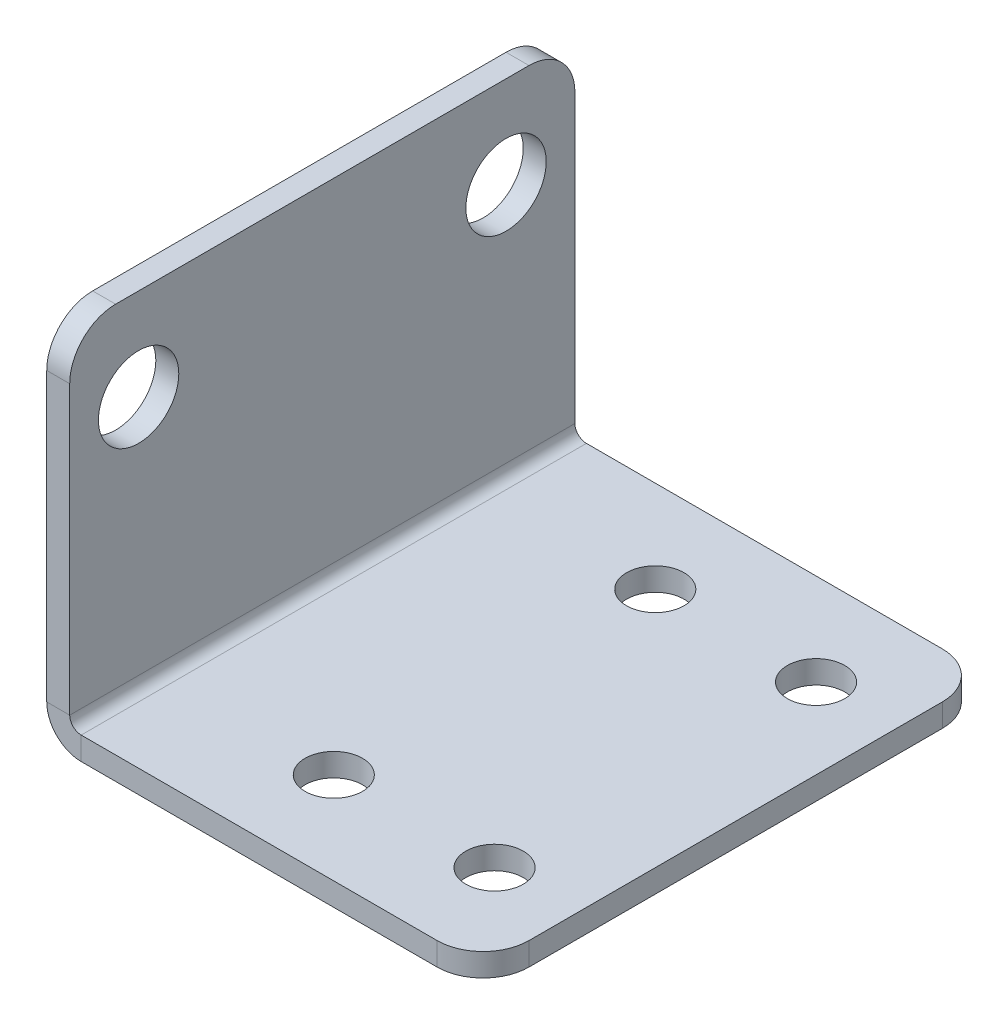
ISO-10303-21;
HEADER;
FILE_DESCRIPTION(('STEP AP214'),'2;1');
FILE_NAME('part.step','',(''),(''),'','','');
FILE_SCHEMA(('AUTOMOTIVE_DESIGN { 1 0 10303 214 1 1 1 1 }'));
ENDSEC;
DATA;
#1=APPLICATION_CONTEXT('core data for automotive mechanical design processes');
#2=APPLICATION_PROTOCOL_DEFINITION('international standard','automotive_design',2000,#1);
#3=PRODUCT_CONTEXT('',#1,'mechanical');
#4=PRODUCT('Part','Part','',(#3));
#5=PRODUCT_RELATED_PRODUCT_CATEGORY('part','',(#4));
#6=PRODUCT_DEFINITION_FORMATION('','',#4);
#7=PRODUCT_DEFINITION_CONTEXT('part definition',#1,'design');
#8=PRODUCT_DEFINITION('design','',#6,#7);
#9=PRODUCT_DEFINITION_SHAPE('','',#8);
#10=(LENGTH_UNIT() NAMED_UNIT(*) SI_UNIT(.MILLI.,.METRE.));
#11=(NAMED_UNIT(*) PLANE_ANGLE_UNIT() SI_UNIT($,.RADIAN.));
#12=(NAMED_UNIT(*) SI_UNIT($,.STERADIAN.) SOLID_ANGLE_UNIT());
#13=UNCERTAINTY_MEASURE_WITH_UNIT(LENGTH_MEASURE(1.E-05),#10,'distance_accuracy_value','');
#14=(GEOMETRIC_REPRESENTATION_CONTEXT(3) GLOBAL_UNCERTAINTY_ASSIGNED_CONTEXT((#13)) GLOBAL_UNIT_ASSIGNED_CONTEXT((#10,
#11,#12)) REPRESENTATION_CONTEXT('',''));
#15=CARTESIAN_POINT('',(0.,0.,0.));
#16=DIRECTION('',(0.,0.,1.));
#17=DIRECTION('',(1.,0.,0.));
#18=AXIS2_PLACEMENT_3D('',#15,#16,#17);
#19=CARTESIAN_POINT('',(0.5,0.,11.));
#20=DIRECTION('',(0.,0.,1.));
#21=DIRECTION('',(1.,0.,0.));
#22=AXIS2_PLACEMENT_3D('',#19,#20,#21);
#23=PLANE('',#22);
#24=DIRECTION('',(0.,-1.,0.));
#25=VECTOR('',#24,1.);
#26=CARTESIAN_POINT('',(0.5,0.,11.));
#27=LINE('',#26,#25);
#28=CARTESIAN_POINT('',(0.5,0.,11.));
#29=VERTEX_POINT('',#28);
#30=CARTESIAN_POINT('',(0.5,-1.,11.));
#31=VERTEX_POINT('',#30);
#32=EDGE_CURVE('E128',#29,#31,#27,.T.);
#33=ORIENTED_EDGE('',*,*,#32,.F.);
#34=CARTESIAN_POINT('',(0.5,0.5,11.));
#35=DIRECTION('',(0.,0.,-1.));
#36=DIRECTION('',(-1.,0.,0.));
#37=AXIS2_PLACEMENT_3D('',#34,#35,#36);
#38=CIRCLE('',#37,0.5);
#39=CARTESIAN_POINT('',(0.,0.5,11.));
#40=VERTEX_POINT('',#39);
#41=EDGE_CURVE('E132',#40,#29,#38,.F.);
#42=ORIENTED_EDGE('',*,*,#41,.F.);
#43=DIRECTION('',(1.,0.,0.));
#44=VECTOR('',#43,1.);
#45=CARTESIAN_POINT('',(-1.,0.500000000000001,11.));
#46=LINE('',#45,#44);
#47=CARTESIAN_POINT('',(-1.,0.500000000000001,11.));
#48=VERTEX_POINT('',#47);
#49=EDGE_CURVE('E140',#48,#40,#46,.T.);
#50=ORIENTED_EDGE('',*,*,#49,.F.);
#51=CARTESIAN_POINT('',(0.5,0.5,11.));
#52=DIRECTION('',(0.,0.,1.));
#53=DIRECTION('',(1.,0.,0.));
#54=AXIS2_PLACEMENT_3D('',#51,#52,#53);
#55=CIRCLE('',#54,1.5);
#56=EDGE_CURVE('E134',#48,#31,#55,.T.);
#57=ORIENTED_EDGE('',*,*,#56,.T.);
#58=EDGE_LOOP('',(#33,#42,#50,#57));
#59=FACE_BOUND('',#58,.T.);
#60=ADVANCED_FACE('F38',(#59),#23,.T.);
#61=CARTESIAN_POINT('',(-1.,0.500000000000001,11.));
#62=DIRECTION('',(0.,0.,1.));
#63=DIRECTION('',(1.,0.,0.));
#64=AXIS2_PLACEMENT_3D('',#61,#62,#63);
#65=PLANE('',#64);
#66=DIRECTION('',(1.,0.,0.));
#67=VECTOR('',#66,1.);
#68=CARTESIAN_POINT('',(0.,-1.,11.));
#69=LINE('',#68,#67);
#70=CARTESIAN_POINT('',(16.,-1.,11.));
#71=VERTEX_POINT('',#70);
#72=EDGE_CURVE('E162',#31,#71,#69,.T.);
#73=ORIENTED_EDGE('',*,*,#72,.T.);
#74=DIRECTION('',(0.,-1.,0.));
#75=VECTOR('',#74,1.);
#76=CARTESIAN_POINT('',(16.,0.500000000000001,11.));
#77=LINE('',#76,#75);
#78=CARTESIAN_POINT('',(16.,0.,11.));
#79=VERTEX_POINT('',#78);
#80=EDGE_CURVE('E161',#71,#79,#77,.F.);
#81=ORIENTED_EDGE('',*,*,#80,.T.);
#82=DIRECTION('',(1.,0.,0.));
#83=VECTOR('',#82,1.);
#84=CARTESIAN_POINT('',(0.,0.,11.));
#85=LINE('',#84,#83);
#86=EDGE_CURVE('E149',#29,#79,#85,.T.);
#87=ORIENTED_EDGE('',*,*,#86,.F.);
#88=ORIENTED_EDGE('',*,*,#32,.T.);
#89=EDGE_LOOP('',(#73,#81,#87,#88));
#90=FACE_BOUND('',#89,.T.);
#91=ADVANCED_FACE('F159',(#90),#65,.T.);
#92=CARTESIAN_POINT('',(0.,0.5,-11.));
#93=DIRECTION('',(0.,0.,-1.));
#94=DIRECTION('',(-1.,0.,0.));
#95=AXIS2_PLACEMENT_3D('',#92,#93,#94);
#96=PLANE('',#95);
#97=DIRECTION('',(-1.,0.,0.));
#98=VECTOR('',#97,1.);
#99=CARTESIAN_POINT('',(0.,0.5,-11.));
#100=LINE('',#99,#98);
#101=CARTESIAN_POINT('',(0.,0.5,-11.));
#102=VERTEX_POINT('',#101);
#103=CARTESIAN_POINT('',(-1.,0.500000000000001,-11.));
#104=VERTEX_POINT('',#103);
#105=EDGE_CURVE('E206',#102,#104,#100,.T.);
#106=ORIENTED_EDGE('',*,*,#105,.F.);
#107=CARTESIAN_POINT('',(0.5,0.5,-11.));
#108=DIRECTION('',(0.,0.,-1.));
#109=DIRECTION('',(-1.,0.,0.));
#110=AXIS2_PLACEMENT_3D('',#107,#108,#109);
#111=CIRCLE('',#110,0.5);
#112=CARTESIAN_POINT('',(0.5,0.,-11.));
#113=VERTEX_POINT('',#112);
#114=EDGE_CURVE('E181',#102,#113,#111,.F.);
#115=ORIENTED_EDGE('',*,*,#114,.T.);
#116=DIRECTION('',(0.,1.,0.));
#117=VECTOR('',#116,1.);
#118=CARTESIAN_POINT('',(0.5,-1.,-11.));
#119=LINE('',#118,#117);
#120=CARTESIAN_POINT('',(0.5,-1.,-11.));
#121=VERTEX_POINT('',#120);
#122=EDGE_CURVE('E204',#121,#113,#119,.T.);
#123=ORIENTED_EDGE('',*,*,#122,.F.);
#124=CARTESIAN_POINT('',(0.5,0.5,-11.));
#125=DIRECTION('',(0.,0.,1.));
#126=DIRECTION('',(1.,0.,0.));
#127=AXIS2_PLACEMENT_3D('',#124,#125,#126);
#128=CIRCLE('',#127,1.5);
#129=EDGE_CURVE('E187',#104,#121,#128,.T.);
#130=ORIENTED_EDGE('',*,*,#129,.F.);
#131=EDGE_LOOP('',(#106,#115,#123,#130));
#132=FACE_BOUND('',#131,.T.);
#133=ADVANCED_FACE('F333',(#132),#96,.T.);
#134=CARTESIAN_POINT('',(0.5,-1.,-11.));
#135=DIRECTION('',(0.,0.,-1.));
#136=DIRECTION('',(-1.,0.,0.));
#137=AXIS2_PLACEMENT_3D('',#134,#135,#136);
#138=PLANE('',#137);
#139=DIRECTION('',(0.,-1.,0.));
#140=VECTOR('',#139,1.);
#141=CARTESIAN_POINT('',(-1.,15.,-11.));
#142=LINE('',#141,#140);
#143=CARTESIAN_POINT('',(-1.,13.,-11.));
#144=VERTEX_POINT('',#143);
#145=EDGE_CURVE('E185',#144,#104,#142,.T.);
#146=ORIENTED_EDGE('',*,*,#145,.F.);
#147=DIRECTION('',(1.,0.,0.));
#148=VECTOR('',#147,1.);
#149=CARTESIAN_POINT('',(0.5,13.,-11.));
#150=LINE('',#149,#148);
#151=CARTESIAN_POINT('',(0.,13.,-11.));
#152=VERTEX_POINT('',#151);
#153=EDGE_CURVE('E227',#144,#152,#150,.T.);
#154=ORIENTED_EDGE('',*,*,#153,.T.);
#155=DIRECTION('',(0.,-1.,0.));
#156=VECTOR('',#155,1.);
#157=CARTESIAN_POINT('',(0.,15.,-11.));
#158=LINE('',#157,#156);
#159=EDGE_CURVE('E183',#152,#102,#158,.T.);
#160=ORIENTED_EDGE('',*,*,#159,.T.);
#161=ORIENTED_EDGE('',*,*,#105,.T.);
#162=EDGE_LOOP('',(#146,#154,#160,#161));
#163=FACE_BOUND('',#162,.T.);
#164=ADVANCED_FACE('F247',(#163),#138,.T.);
#165=CARTESIAN_POINT('',(0.,-1.,11.));
#166=DIRECTION('',(0.,1.,0.));
#167=DIRECTION('',(0.,0.,1.));
#168=AXIS2_PLACEMENT_3D('',#165,#166,#167);
#169=PLANE('',#168);
#170=CARTESIAN_POINT('',(7.5,-1.,-7.));
#171=DIRECTION('',(0.,1.,0.));
#172=DIRECTION('',(0.,0.,1.));
#173=AXIS2_PLACEMENT_3D('',#170,#171,#172);
#174=CIRCLE('',#173,1.24999999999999);
#175=CARTESIAN_POINT('',(7.5,-1.,-5.75000000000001));
#176=VERTEX_POINT('',#175);
#177=EDGE_CURVE('E285',#176,#176,#174,.T.);
#178=ORIENTED_EDGE('',*,*,#177,.T.);
#179=EDGE_LOOP('',(#178));
#180=FACE_BOUND('',#179,.T.);
#181=CARTESIAN_POINT('',(14.5,-1.,-7.));
#182=DIRECTION('',(0.,1.,0.));
#183=DIRECTION('',(0.,0.,1.));
#184=AXIS2_PLACEMENT_3D('',#181,#182,#183);
#185=CIRCLE('',#184,1.24999999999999);
#186=CARTESIAN_POINT('',(14.5,-1.,-5.75000000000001));
#187=VERTEX_POINT('',#186);
#188=EDGE_CURVE('E279',#187,#187,#185,.T.);
#189=ORIENTED_EDGE('',*,*,#188,.T.);
#190=EDGE_LOOP('',(#189));
#191=FACE_BOUND('',#190,.T.);
#192=CARTESIAN_POINT('',(7.5,-1.,7.));
#193=DIRECTION('',(0.,1.,0.));
#194=DIRECTION('',(0.,0.,1.));
#195=AXIS2_PLACEMENT_3D('',#192,#193,#194);
#196=CIRCLE('',#195,1.24999999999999);
#197=CARTESIAN_POINT('',(7.5,-1.,8.24999999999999));
#198=VERTEX_POINT('',#197);
#199=EDGE_CURVE('E273',#198,#198,#196,.T.);
#200=ORIENTED_EDGE('',*,*,#199,.T.);
#201=EDGE_LOOP('',(#200));
#202=FACE_BOUND('',#201,.T.);
#203=CARTESIAN_POINT('',(14.5,-1.,7.));
#204=DIRECTION('',(0.,1.,0.));
#205=DIRECTION('',(0.,0.,1.));
#206=AXIS2_PLACEMENT_3D('',#203,#204,#205);
#207=CIRCLE('',#206,1.24999999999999);
#208=CARTESIAN_POINT('',(14.5,-1.,8.24999999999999));
#209=VERTEX_POINT('',#208);
#210=EDGE_CURVE('E179',#209,#209,#207,.T.);
#211=ORIENTED_EDGE('',*,*,#210,.T.);
#212=EDGE_LOOP('',(#211));
#213=FACE_BOUND('',#212,.T.);
#214=DIRECTION('',(1.,0.,0.));
#215=VECTOR('',#214,1.);
#216=CARTESIAN_POINT('',(0.,-1.,-11.));
#217=LINE('',#216,#215);
#218=CARTESIAN_POINT('',(16.,-1.,-11.));
#219=VERTEX_POINT('',#218);
#220=EDGE_CURVE('E176',#121,#219,#217,.T.);
#221=ORIENTED_EDGE('',*,*,#220,.T.);
#222=CARTESIAN_POINT('',(16.,-1.,-9.));
#223=DIRECTION('',(0.,1.,0.));
#224=DIRECTION('',(0.,0.,1.));
#225=AXIS2_PLACEMENT_3D('',#222,#223,#224);
#226=CIRCLE('',#225,2.);
#227=CARTESIAN_POINT('',(18.,-1.,-9.));
#228=VERTEX_POINT('',#227);
#229=EDGE_CURVE('E215',#219,#228,#226,.F.);
#230=ORIENTED_EDGE('',*,*,#229,.T.);
#231=DIRECTION('',(0.,0.,-1.));
#232=VECTOR('',#231,1.);
#233=CARTESIAN_POINT('',(18.,-1.,11.));
#234=LINE('',#233,#232);
#235=CARTESIAN_POINT('',(18.,-1.,9.));
#236=VERTEX_POINT('',#235);
#237=EDGE_CURVE('E201',#236,#228,#234,.T.);
#238=ORIENTED_EDGE('',*,*,#237,.F.);
#239=CARTESIAN_POINT('',(16.,-1.,9.));
#240=DIRECTION('',(0.,1.,0.));
#241=DIRECTION('',(0.,0.,1.));
#242=AXIS2_PLACEMENT_3D('',#239,#240,#241);
#243=CIRCLE('',#242,2.);
#244=EDGE_CURVE('E213',#236,#71,#243,.F.);
#245=ORIENTED_EDGE('',*,*,#244,.T.);
#246=ORIENTED_EDGE('',*,*,#72,.F.);
#247=DIRECTION('',(0.,0.,-1.));
#248=VECTOR('',#247,1.);
#249=CARTESIAN_POINT('',(0.5,-1.,11.));
#250=LINE('',#249,#248);
#251=EDGE_CURVE('E175',#31,#121,#250,.T.);
#252=ORIENTED_EDGE('',*,*,#251,.T.);
#253=EDGE_LOOP('',(#221,#230,#238,#245,#246,#252));
#254=FACE_BOUND('',#253,.T.);
#255=ADVANCED_FACE('F265',(#180,#191,#202,#213,#254),#169,.F.);
#256=CARTESIAN_POINT('',(18.,0.,11.));
#257=DIRECTION('',(1.,0.,0.));
#258=DIRECTION('',(0.,0.,-1.));
#259=AXIS2_PLACEMENT_3D('',#256,#257,#258);
#260=PLANE('',#259);
#261=ORIENTED_EDGE('',*,*,#237,.T.);
#262=DIRECTION('',(0.,-1.,0.));
#263=VECTOR('',#262,1.);
#264=CARTESIAN_POINT('',(18.,0.,-9.));
#265=LINE('',#264,#263);
#266=CARTESIAN_POINT('',(18.,0.,-9.));
#267=VERTEX_POINT('',#266);
#268=EDGE_CURVE('E220',#228,#267,#265,.F.);
#269=ORIENTED_EDGE('',*,*,#268,.T.);
#270=DIRECTION('',(0.,0.,-1.));
#271=VECTOR('',#270,1.);
#272=CARTESIAN_POINT('',(18.,0.,11.));
#273=LINE('',#272,#271);
#274=CARTESIAN_POINT('',(18.,0.,9.));
#275=VERTEX_POINT('',#274);
#276=EDGE_CURVE('E156',#275,#267,#273,.T.);
#277=ORIENTED_EDGE('',*,*,#276,.F.);
#278=DIRECTION('',(0.,-1.,0.));
#279=VECTOR('',#278,1.);
#280=CARTESIAN_POINT('',(18.,0.,9.));
#281=LINE('',#280,#279);
#282=EDGE_CURVE('E217',#275,#236,#281,.T.);
#283=ORIENTED_EDGE('',*,*,#282,.T.);
#284=EDGE_LOOP('',(#261,#269,#277,#283));
#285=FACE_BOUND('',#284,.T.);
#286=ADVANCED_FACE('F422',(#285),#260,.T.);
#287=CARTESIAN_POINT('',(0.,0.,11.));
#288=DIRECTION('',(0.,1.,0.));
#289=DIRECTION('',(0.,0.,1.));
#290=AXIS2_PLACEMENT_3D('',#287,#288,#289);
#291=PLANE('',#290);
#292=CARTESIAN_POINT('',(7.5,0.,-7.));
#293=DIRECTION('',(0.,1.,0.));
#294=DIRECTION('',(0.,0.,1.));
#295=AXIS2_PLACEMENT_3D('',#292,#293,#294);
#296=CIRCLE('',#295,1.24999999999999);
#297=CARTESIAN_POINT('',(7.5,0.,-5.75000000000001));
#298=VERTEX_POINT('',#297);
#299=EDGE_CURVE('E288',#298,#298,#296,.T.);
#300=ORIENTED_EDGE('',*,*,#299,.F.);
#301=EDGE_LOOP('',(#300));
#302=FACE_BOUND('',#301,.T.);
#303=CARTESIAN_POINT('',(14.5,0.,-7.));
#304=DIRECTION('',(0.,1.,0.));
#305=DIRECTION('',(0.,0.,1.));
#306=AXIS2_PLACEMENT_3D('',#303,#304,#305);
#307=CIRCLE('',#306,1.24999999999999);
#308=CARTESIAN_POINT('',(14.5,0.,-5.75000000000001));
#309=VERTEX_POINT('',#308);
#310=EDGE_CURVE('E282',#309,#309,#307,.T.);
#311=ORIENTED_EDGE('',*,*,#310,.F.);
#312=EDGE_LOOP('',(#311));
#313=FACE_BOUND('',#312,.T.);
#314=CARTESIAN_POINT('',(7.5,0.,7.));
#315=DIRECTION('',(0.,1.,0.));
#316=DIRECTION('',(0.,0.,1.));
#317=AXIS2_PLACEMENT_3D('',#314,#315,#316);
#318=CIRCLE('',#317,1.24999999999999);
#319=CARTESIAN_POINT('',(7.5,0.,8.24999999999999));
#320=VERTEX_POINT('',#319);
#321=EDGE_CURVE('E276',#320,#320,#318,.T.);
#322=ORIENTED_EDGE('',*,*,#321,.F.);
#323=EDGE_LOOP('',(#322));
#324=FACE_BOUND('',#323,.T.);
#325=CARTESIAN_POINT('',(14.5,0.,7.));
#326=DIRECTION('',(0.,1.,0.));
#327=DIRECTION('',(0.,0.,1.));
#328=AXIS2_PLACEMENT_3D('',#325,#326,#327);
#329=CIRCLE('',#328,1.24999999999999);
#330=CARTESIAN_POINT('',(14.5,0.,8.24999999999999));
#331=VERTEX_POINT('',#330);
#332=EDGE_CURVE('E270',#331,#331,#329,.T.);
#333=ORIENTED_EDGE('',*,*,#332,.F.);
#334=EDGE_LOOP('',(#333));
#335=FACE_BOUND('',#334,.T.);
#336=ORIENTED_EDGE('',*,*,#276,.T.);
#337=CARTESIAN_POINT('',(16.,0.,-9.));
#338=DIRECTION('',(0.,1.,0.));
#339=DIRECTION('',(0.,0.,1.));
#340=AXIS2_PLACEMENT_3D('',#337,#338,#339);
#341=CIRCLE('',#340,2.);
#342=CARTESIAN_POINT('',(16.,0.,-11.));
#343=VERTEX_POINT('',#342);
#344=EDGE_CURVE('E224',#267,#343,#341,.T.);
#345=ORIENTED_EDGE('',*,*,#344,.T.);
#346=DIRECTION('',(1.,0.,0.));
#347=VECTOR('',#346,1.);
#348=CARTESIAN_POINT('',(0.,0.,-11.));
#349=LINE('',#348,#347);
#350=EDGE_CURVE('E152',#113,#343,#349,.T.);
#351=ORIENTED_EDGE('',*,*,#350,.F.);
#352=DIRECTION('',(0.,0.,-1.));
#353=VECTOR('',#352,1.);
#354=CARTESIAN_POINT('',(0.5,0.,11.));
#355=LINE('',#354,#353);
#356=EDGE_CURVE('E146',#29,#113,#355,.T.);
#357=ORIENTED_EDGE('',*,*,#356,.F.);
#358=ORIENTED_EDGE('',*,*,#86,.T.);
#359=CARTESIAN_POINT('',(16.,0.,9.));
#360=DIRECTION('',(0.,1.,0.));
#361=DIRECTION('',(0.,0.,1.));
#362=AXIS2_PLACEMENT_3D('',#359,#360,#361);
#363=CIRCLE('',#362,2.);
#364=EDGE_CURVE('E222',#79,#275,#363,.T.);
#365=ORIENTED_EDGE('',*,*,#364,.T.);
#366=EDGE_LOOP('',(#336,#345,#351,#357,#358,#365));
#367=FACE_BOUND('',#366,.T.);
#368=ADVANCED_FACE('F148',(#302,#313,#324,#335,#367),#291,.T.);
#369=CARTESIAN_POINT('',(0.5,0.5,11.));
#370=DIRECTION('',(0.,0.,-1.));
#371=DIRECTION('',(-1.,0.,0.));
#372=AXIS2_PLACEMENT_3D('',#369,#370,#371);
#373=CYLINDRICAL_SURFACE('',#372,0.5);
#374=ORIENTED_EDGE('',*,*,#114,.F.);
#375=DIRECTION('',(0.,0.,-1.));
#376=VECTOR('',#375,1.);
#377=CARTESIAN_POINT('',(0.,0.5,11.));
#378=LINE('',#377,#376);
#379=EDGE_CURVE('E157',#40,#102,#378,.T.);
#380=ORIENTED_EDGE('',*,*,#379,.F.);
#381=ORIENTED_EDGE('',*,*,#41,.T.);
#382=ORIENTED_EDGE('',*,*,#356,.T.);
#383=EDGE_LOOP('',(#374,#380,#381,#382));
#384=FACE_BOUND('',#383,.T.);
#385=ADVANCED_FACE('F165',(#384),#373,.F.);
#386=CARTESIAN_POINT('',(0.,15.,11.));
#387=DIRECTION('',(1.,0.,0.));
#388=DIRECTION('',(0.,1.,0.));
#389=AXIS2_PLACEMENT_3D('',#386,#387,#388);
#390=PLANE('',#389);
#391=CARTESIAN_POINT('',(0.,11.,8.));
#392=DIRECTION('',(1.,0.,0.));
#393=DIRECTION('',(0.,0.,-1.));
#394=AXIS2_PLACEMENT_3D('',#391,#392,#393);
#395=CIRCLE('',#394,1.75);
#396=CARTESIAN_POINT('',(0.,11.,6.25));
#397=VERTEX_POINT('',#396);
#398=EDGE_CURVE('E300',#397,#397,#395,.T.);
#399=ORIENTED_EDGE('',*,*,#398,.F.);
#400=EDGE_LOOP('',(#399));
#401=FACE_BOUND('',#400,.T.);
#402=CARTESIAN_POINT('',(0.,11.,-8.));
#403=DIRECTION('',(1.,0.,0.));
#404=DIRECTION('',(0.,0.,-1.));
#405=AXIS2_PLACEMENT_3D('',#402,#403,#404);
#406=CIRCLE('',#405,1.75);
#407=CARTESIAN_POINT('',(0.,11.,-9.75));
#408=VERTEX_POINT('',#407);
#409=EDGE_CURVE('E294',#408,#408,#406,.T.);
#410=ORIENTED_EDGE('',*,*,#409,.F.);
#411=EDGE_LOOP('',(#410));
#412=FACE_BOUND('',#411,.T.);
#413=ORIENTED_EDGE('',*,*,#159,.F.);
#414=CARTESIAN_POINT('',(0.,13.,-9.));
#415=DIRECTION('',(1.,0.,0.));
#416=DIRECTION('',(0.,1.,0.));
#417=AXIS2_PLACEMENT_3D('',#414,#415,#416);
#418=CIRCLE('',#417,2.);
#419=CARTESIAN_POINT('',(0.,15.,-9.));
#420=VERTEX_POINT('',#419);
#421=EDGE_CURVE('E232',#152,#420,#418,.T.);
#422=ORIENTED_EDGE('',*,*,#421,.T.);
#423=DIRECTION('',(0.,0.,-1.));
#424=VECTOR('',#423,1.);
#425=CARTESIAN_POINT('',(0.,15.,11.));
#426=LINE('',#425,#424);
#427=CARTESIAN_POINT('',(0.,15.,9.));
#428=VERTEX_POINT('',#427);
#429=EDGE_CURVE('E197',#428,#420,#426,.T.);
#430=ORIENTED_EDGE('',*,*,#429,.F.);
#431=CARTESIAN_POINT('',(0.,13.,9.));
#432=DIRECTION('',(1.,0.,0.));
#433=DIRECTION('',(0.,1.,0.));
#434=AXIS2_PLACEMENT_3D('',#431,#432,#433);
#435=CIRCLE('',#434,2.);
#436=CARTESIAN_POINT('',(0.,13.,11.));
#437=VERTEX_POINT('',#436);
#438=EDGE_CURVE('E230',#428,#437,#435,.T.);
#439=ORIENTED_EDGE('',*,*,#438,.T.);
#440=DIRECTION('',(0.,-1.,0.));
#441=VECTOR('',#440,1.);
#442=CARTESIAN_POINT('',(0.,15.,11.));
#443=LINE('',#442,#441);
#444=EDGE_CURVE('E167',#437,#40,#443,.T.);
#445=ORIENTED_EDGE('',*,*,#444,.T.);
#446=ORIENTED_EDGE('',*,*,#379,.T.);
#447=EDGE_LOOP('',(#413,#422,#430,#439,#445,#446));
#448=FACE_BOUND('',#447,.T.);
#449=ADVANCED_FACE('F253',(#401,#412,#448),#390,.T.);
#450=CARTESIAN_POINT('',(-1.,15.,11.));
#451=DIRECTION('',(0.,1.,0.));
#452=DIRECTION('',(0.,0.,1.));
#453=AXIS2_PLACEMENT_3D('',#450,#451,#452);
#454=PLANE('',#453);
#455=ORIENTED_EDGE('',*,*,#429,.T.);
#456=DIRECTION('',(1.,0.,0.));
#457=VECTOR('',#456,1.);
#458=CARTESIAN_POINT('',(-1.,15.,-9.));
#459=LINE('',#458,#457);
#460=CARTESIAN_POINT('',(-1.,15.,-9.));
#461=VERTEX_POINT('',#460);
#462=EDGE_CURVE('E59',#420,#461,#459,.F.);
#463=ORIENTED_EDGE('',*,*,#462,.T.);
#464=DIRECTION('',(0.,0.,-1.));
#465=VECTOR('',#464,1.);
#466=CARTESIAN_POINT('',(-1.,15.,11.));
#467=LINE('',#466,#465);
#468=CARTESIAN_POINT('',(-1.,15.,9.));
#469=VERTEX_POINT('',#468);
#470=EDGE_CURVE('E195',#469,#461,#467,.T.);
#471=ORIENTED_EDGE('',*,*,#470,.F.);
#472=DIRECTION('',(1.,0.,0.));
#473=VECTOR('',#472,1.);
#474=CARTESIAN_POINT('',(0.,15.,9.));
#475=LINE('',#474,#473);
#476=EDGE_CURVE('E234',#469,#428,#475,.T.);
#477=ORIENTED_EDGE('',*,*,#476,.T.);
#478=EDGE_LOOP('',(#455,#463,#471,#477));
#479=FACE_BOUND('',#478,.T.);
#480=ADVANCED_FACE('F254',(#479),#454,.T.);
#481=CARTESIAN_POINT('',(-1.,15.,11.));
#482=DIRECTION('',(1.,0.,0.));
#483=DIRECTION('',(0.,1.,0.));
#484=AXIS2_PLACEMENT_3D('',#481,#482,#483);
#485=PLANE('',#484);
#486=CARTESIAN_POINT('',(-1.,11.,8.));
#487=DIRECTION('',(1.,0.,0.));
#488=DIRECTION('',(0.,1.,0.));
#489=AXIS2_PLACEMENT_3D('',#486,#487,#488);
#490=CIRCLE('',#489,1.75);
#491=CARTESIAN_POINT('',(-1.,12.75,8.));
#492=VERTEX_POINT('',#491);
#493=EDGE_CURVE('E297',#492,#492,#490,.T.);
#494=ORIENTED_EDGE('',*,*,#493,.T.);
#495=EDGE_LOOP('',(#494));
#496=FACE_BOUND('',#495,.T.);
#497=CARTESIAN_POINT('',(-1.,11.,-8.));
#498=DIRECTION('',(1.,0.,0.));
#499=DIRECTION('',(0.,1.,0.));
#500=AXIS2_PLACEMENT_3D('',#497,#498,#499);
#501=CIRCLE('',#500,1.75);
#502=CARTESIAN_POINT('',(-1.,12.75,-8.));
#503=VERTEX_POINT('',#502);
#504=EDGE_CURVE('E291',#503,#503,#501,.T.);
#505=ORIENTED_EDGE('',*,*,#504,.T.);
#506=EDGE_LOOP('',(#505));
#507=FACE_BOUND('',#506,.T.);
#508=ORIENTED_EDGE('',*,*,#470,.T.);
#509=CARTESIAN_POINT('',(-1.,13.,-9.));
#510=DIRECTION('',(1.,0.,0.));
#511=DIRECTION('',(0.,1.,0.));
#512=AXIS2_PLACEMENT_3D('',#509,#510,#511);
#513=CIRCLE('',#512,2.);
#514=EDGE_CURVE('E46',#461,#144,#513,.F.);
#515=ORIENTED_EDGE('',*,*,#514,.T.);
#516=ORIENTED_EDGE('',*,*,#145,.T.);
#517=DIRECTION('',(0.,0.,-1.));
#518=VECTOR('',#517,1.);
#519=CARTESIAN_POINT('',(-1.,0.500000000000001,11.));
#520=LINE('',#519,#518);
#521=EDGE_CURVE('E192',#48,#104,#520,.T.);
#522=ORIENTED_EDGE('',*,*,#521,.F.);
#523=DIRECTION('',(0.,-1.,0.));
#524=VECTOR('',#523,1.);
#525=CARTESIAN_POINT('',(-1.,15.,11.));
#526=LINE('',#525,#524);
#527=CARTESIAN_POINT('',(-1.,13.,11.));
#528=VERTEX_POINT('',#527);
#529=EDGE_CURVE('E169',#528,#48,#526,.T.);
#530=ORIENTED_EDGE('',*,*,#529,.F.);
#531=CARTESIAN_POINT('',(-1.,13.,9.));
#532=DIRECTION('',(1.,0.,0.));
#533=DIRECTION('',(0.,1.,0.));
#534=AXIS2_PLACEMENT_3D('',#531,#532,#533);
#535=CIRCLE('',#534,2.);
#536=EDGE_CURVE('E238',#528,#469,#535,.F.);
#537=ORIENTED_EDGE('',*,*,#536,.T.);
#538=EDGE_LOOP('',(#508,#515,#516,#522,#530,#537));
#539=FACE_BOUND('',#538,.T.);
#540=ADVANCED_FACE('F242',(#496,#507,#539),#485,.F.);
#541=CARTESIAN_POINT('',(0.5,0.5,11.));
#542=DIRECTION('',(0.,0.,-1.));
#543=DIRECTION('',(-1.,0.,0.));
#544=AXIS2_PLACEMENT_3D('',#541,#542,#543);
#545=CYLINDRICAL_SURFACE('',#544,1.5);
#546=ORIENTED_EDGE('',*,*,#129,.T.);
#547=ORIENTED_EDGE('',*,*,#251,.F.);
#548=ORIENTED_EDGE('',*,*,#56,.F.);
#549=ORIENTED_EDGE('',*,*,#521,.T.);
#550=EDGE_LOOP('',(#546,#547,#548,#549));
#551=FACE_BOUND('',#550,.T.);
#552=ADVANCED_FACE('F261',(#551),#545,.T.);
#553=CARTESIAN_POINT('',(0.5,0.5,11.));
#554=DIRECTION('',(0.,0.,-1.));
#555=DIRECTION('',(-1.,0.,0.));
#556=AXIS2_PLACEMENT_3D('',#553,#554,#555);
#557=PLANE('',#556);
#558=ORIENTED_EDGE('',*,*,#444,.F.);
#559=DIRECTION('',(1.,0.,0.));
#560=VECTOR('',#559,1.);
#561=CARTESIAN_POINT('',(-1.,13.,11.));
#562=LINE('',#561,#560);
#563=EDGE_CURVE('E11',#437,#528,#562,.F.);
#564=ORIENTED_EDGE('',*,*,#563,.T.);
#565=ORIENTED_EDGE('',*,*,#529,.T.);
#566=ORIENTED_EDGE('',*,*,#49,.T.);
#567=EDGE_LOOP('',(#558,#564,#565,#566));
#568=FACE_BOUND('',#567,.T.);
#569=ADVANCED_FACE('F258',(#568),#557,.F.);
#570=CARTESIAN_POINT('',(0.5,0.5,-11.));
#571=DIRECTION('',(0.,0.,-1.));
#572=DIRECTION('',(-1.,0.,0.));
#573=AXIS2_PLACEMENT_3D('',#570,#571,#572);
#574=PLANE('',#573);
#575=ORIENTED_EDGE('',*,*,#350,.T.);
#576=DIRECTION('',(0.,-1.,0.));
#577=VECTOR('',#576,1.);
#578=CARTESIAN_POINT('',(16.,0.5,-11.));
#579=LINE('',#578,#577);
#580=EDGE_CURVE('E139',#343,#219,#579,.T.);
#581=ORIENTED_EDGE('',*,*,#580,.T.);
#582=ORIENTED_EDGE('',*,*,#220,.F.);
#583=ORIENTED_EDGE('',*,*,#122,.T.);
#584=EDGE_LOOP('',(#575,#581,#582,#583));
#585=FACE_BOUND('',#584,.T.);
#586=ADVANCED_FACE('F373',(#585),#574,.T.);
#587=CARTESIAN_POINT('',(14.5,0.,7.));
#588=DIRECTION('',(0.,1.,0.));
#589=DIRECTION('',(0.,0.,1.));
#590=AXIS2_PLACEMENT_3D('',#587,#588,#589);
#591=CYLINDRICAL_SURFACE('',#590,1.24999999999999);
#592=ORIENTED_EDGE('',*,*,#332,.T.);
#593=EDGE_LOOP('',(#592));
#594=FACE_BOUND('',#593,.T.);
#595=ORIENTED_EDGE('',*,*,#210,.F.);
#596=EDGE_LOOP('',(#595));
#597=FACE_BOUND('',#596,.T.);
#598=ADVANCED_FACE('F378',(#594,#597),#591,.F.);
#599=CARTESIAN_POINT('',(7.5,0.,7.));
#600=DIRECTION('',(0.,1.,0.));
#601=DIRECTION('',(0.,0.,1.));
#602=AXIS2_PLACEMENT_3D('',#599,#600,#601);
#603=CYLINDRICAL_SURFACE('',#602,1.24999999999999);
#604=ORIENTED_EDGE('',*,*,#321,.T.);
#605=EDGE_LOOP('',(#604));
#606=FACE_BOUND('',#605,.T.);
#607=ORIENTED_EDGE('',*,*,#199,.F.);
#608=EDGE_LOOP('',(#607));
#609=FACE_BOUND('',#608,.T.);
#610=ADVANCED_FACE('F496',(#606,#609),#603,.F.);
#611=CARTESIAN_POINT('',(14.5,0.,-7.));
#612=DIRECTION('',(0.,1.,0.));
#613=DIRECTION('',(0.,0.,1.));
#614=AXIS2_PLACEMENT_3D('',#611,#612,#613);
#615=CYLINDRICAL_SURFACE('',#614,1.24999999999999);
#616=ORIENTED_EDGE('',*,*,#310,.T.);
#617=EDGE_LOOP('',(#616));
#618=FACE_BOUND('',#617,.T.);
#619=ORIENTED_EDGE('',*,*,#188,.F.);
#620=EDGE_LOOP('',(#619));
#621=FACE_BOUND('',#620,.T.);
#622=ADVANCED_FACE('F485',(#618,#621),#615,.F.);
#623=CARTESIAN_POINT('',(7.5,0.,-7.));
#624=DIRECTION('',(0.,1.,0.));
#625=DIRECTION('',(0.,0.,1.));
#626=AXIS2_PLACEMENT_3D('',#623,#624,#625);
#627=CYLINDRICAL_SURFACE('',#626,1.24999999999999);
#628=ORIENTED_EDGE('',*,*,#299,.T.);
#629=EDGE_LOOP('',(#628));
#630=FACE_BOUND('',#629,.T.);
#631=ORIENTED_EDGE('',*,*,#177,.F.);
#632=EDGE_LOOP('',(#631));
#633=FACE_BOUND('',#632,.T.);
#634=ADVANCED_FACE('F315',(#630,#633),#627,.F.);
#635=CARTESIAN_POINT('',(0.,11.,-8.));
#636=DIRECTION('',(1.,0.,0.));
#637=DIRECTION('',(0.,0.,-1.));
#638=AXIS2_PLACEMENT_3D('',#635,#636,#637);
#639=CYLINDRICAL_SURFACE('',#638,1.75);
#640=ORIENTED_EDGE('',*,*,#409,.T.);
#641=EDGE_LOOP('',(#640));
#642=FACE_BOUND('',#641,.T.);
#643=ORIENTED_EDGE('',*,*,#504,.F.);
#644=EDGE_LOOP('',(#643));
#645=FACE_BOUND('',#644,.T.);
#646=ADVANCED_FACE('F312',(#642,#645),#639,.F.);
#647=CARTESIAN_POINT('',(0.,11.,8.));
#648=DIRECTION('',(1.,0.,0.));
#649=DIRECTION('',(0.,0.,-1.));
#650=AXIS2_PLACEMENT_3D('',#647,#648,#649);
#651=CYLINDRICAL_SURFACE('',#650,1.75);
#652=ORIENTED_EDGE('',*,*,#398,.T.);
#653=EDGE_LOOP('',(#652));
#654=FACE_BOUND('',#653,.T.);
#655=ORIENTED_EDGE('',*,*,#493,.F.);
#656=EDGE_LOOP('',(#655));
#657=FACE_BOUND('',#656,.T.);
#658=ADVANCED_FACE('F304',(#654,#657),#651,.F.);
#659=CARTESIAN_POINT('',(16.,0.5,-9.));
#660=DIRECTION('',(0.,-1.,0.));
#661=DIRECTION('',(0.,0.,-1.));
#662=AXIS2_PLACEMENT_3D('',#659,#660,#661);
#663=CYLINDRICAL_SURFACE('',#662,2.);
#664=ORIENTED_EDGE('',*,*,#344,.F.);
#665=ORIENTED_EDGE('',*,*,#268,.F.);
#666=ORIENTED_EDGE('',*,*,#229,.F.);
#667=ORIENTED_EDGE('',*,*,#580,.F.);
#668=EDGE_LOOP('',(#664,#665,#666,#667));
#669=FACE_BOUND('',#668,.T.);
#670=ADVANCED_FACE('F337',(#669),#663,.T.);
#671=CARTESIAN_POINT('',(16.,0.,9.));
#672=DIRECTION('',(0.,-1.,0.));
#673=DIRECTION('',(0.,0.,-1.));
#674=AXIS2_PLACEMENT_3D('',#671,#672,#673);
#675=CYLINDRICAL_SURFACE('',#674,2.);
#676=ORIENTED_EDGE('',*,*,#364,.F.);
#677=ORIENTED_EDGE('',*,*,#80,.F.);
#678=ORIENTED_EDGE('',*,*,#244,.F.);
#679=ORIENTED_EDGE('',*,*,#282,.F.);
#680=EDGE_LOOP('',(#676,#677,#678,#679));
#681=FACE_BOUND('',#680,.T.);
#682=ADVANCED_FACE('F340',(#681),#675,.T.);
#683=CARTESIAN_POINT('',(0.5,13.,-9.));
#684=DIRECTION('',(1.,0.,0.));
#685=DIRECTION('',(0.,0.,-1.));
#686=AXIS2_PLACEMENT_3D('',#683,#684,#685);
#687=CYLINDRICAL_SURFACE('',#686,2.);
#688=ORIENTED_EDGE('',*,*,#514,.F.);
#689=ORIENTED_EDGE('',*,*,#462,.F.);
#690=ORIENTED_EDGE('',*,*,#421,.F.);
#691=ORIENTED_EDGE('',*,*,#153,.F.);
#692=EDGE_LOOP('',(#688,#689,#690,#691));
#693=FACE_BOUND('',#692,.T.);
#694=ADVANCED_FACE('F250',(#693),#687,.T.);
#695=CARTESIAN_POINT('',(-1.,13.,9.));
#696=DIRECTION('',(-1.,0.,0.));
#697=DIRECTION('',(0.,0.,1.));
#698=AXIS2_PLACEMENT_3D('',#695,#696,#697);
#699=CYLINDRICAL_SURFACE('',#698,2.);
#700=ORIENTED_EDGE('',*,*,#536,.F.);
#701=ORIENTED_EDGE('',*,*,#563,.F.);
#702=ORIENTED_EDGE('',*,*,#438,.F.);
#703=ORIENTED_EDGE('',*,*,#476,.F.);
#704=EDGE_LOOP('',(#700,#701,#702,#703));
#705=FACE_BOUND('',#704,.T.);
#706=ADVANCED_FACE('F40',(#705),#699,.T.);
#707=CLOSED_SHELL('',(#60,#91,#133,#164,#255,#286,#368,#385,#449,#480,#540,#552,#569,#586,#598,
#610,#622,#634,#646,#658,#670,#682,#694,#706));
#708=MANIFOLD_SOLID_BREP('B2',#707);
#709=ADVANCED_BREP_SHAPE_REPRESENTATION('',(#18,#708),#14);
#710=SHAPE_DEFINITION_REPRESENTATION(#9,#709);
ENDSEC;
END-ISO-10303-21;
